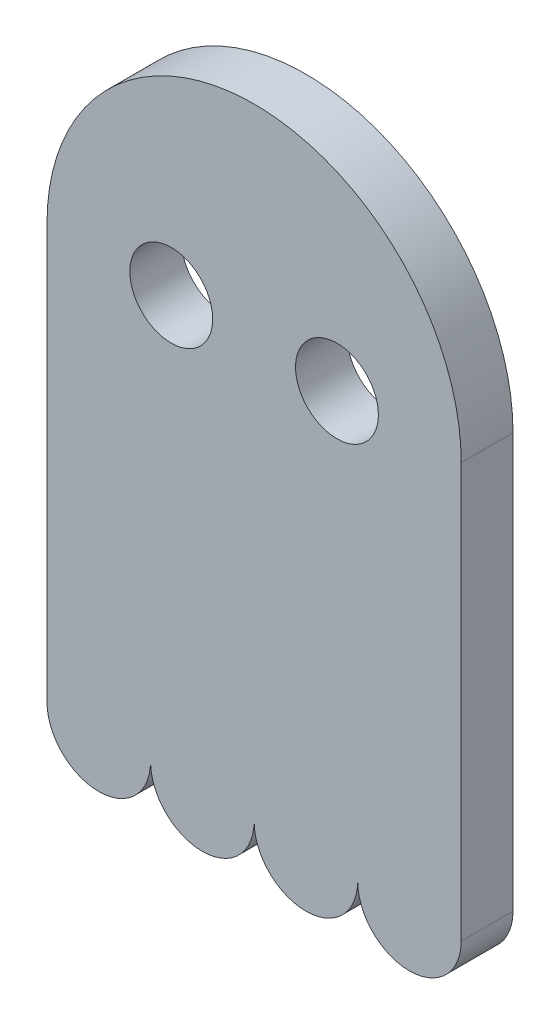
ISO-10303-21;
HEADER;
FILE_DESCRIPTION(('STEP AP214'),'2;1');
FILE_NAME('part.step','',(''),(''),'','','');
FILE_SCHEMA(('AUTOMOTIVE_DESIGN { 1 0 10303 214 1 1 1 1 }'));
ENDSEC;
DATA;
#1=APPLICATION_CONTEXT('core data for automotive mechanical design processes');
#2=APPLICATION_PROTOCOL_DEFINITION('international standard','automotive_design',2000,#1);
#3=PRODUCT_CONTEXT('',#1,'mechanical');
#4=PRODUCT('Part','Part','',(#3));
#5=PRODUCT_RELATED_PRODUCT_CATEGORY('part','',(#4));
#6=PRODUCT_DEFINITION_FORMATION('','',#4);
#7=PRODUCT_DEFINITION_CONTEXT('part definition',#1,'design');
#8=PRODUCT_DEFINITION('design','',#6,#7);
#9=PRODUCT_DEFINITION_SHAPE('','',#8);
#10=(LENGTH_UNIT() NAMED_UNIT(*) SI_UNIT(.MILLI.,.METRE.));
#11=(NAMED_UNIT(*) PLANE_ANGLE_UNIT() SI_UNIT($,.RADIAN.));
#12=(NAMED_UNIT(*) SI_UNIT($,.STERADIAN.) SOLID_ANGLE_UNIT());
#13=UNCERTAINTY_MEASURE_WITH_UNIT(LENGTH_MEASURE(1.E-05),#10,'distance_accuracy_value','');
#14=(GEOMETRIC_REPRESENTATION_CONTEXT(3) GLOBAL_UNCERTAINTY_ASSIGNED_CONTEXT((#13)) GLOBAL_UNIT_ASSIGNED_CONTEXT((#10,
#11,#12)) REPRESENTATION_CONTEXT('',''));
#15=CARTESIAN_POINT('',(0.,0.,0.));
#16=DIRECTION('',(0.,0.,1.));
#17=DIRECTION('',(1.,0.,0.));
#18=AXIS2_PLACEMENT_3D('',#15,#16,#17);
#19=CARTESIAN_POINT('',(-5.,0.,5.));
#20=DIRECTION('',(0.,0.,-1.));
#21=DIRECTION('',(-1.,0.,0.));
#22=AXIS2_PLACEMENT_3D('',#19,#20,#21);
#23=PLANE('',#22);
#24=CARTESIAN_POINT('',(8.,40.,5.));
#25=DIRECTION('',(0.,0.,1.));
#26=DIRECTION('',(1.,0.,0.));
#27=AXIS2_PLACEMENT_3D('',#24,#25,#26);
#28=CIRCLE('',#27,4.);
#29=CARTESIAN_POINT('',(12.,40.,5.));
#30=VERTEX_POINT('',#29);
#31=EDGE_CURVE('E126',#30,#30,#28,.T.);
#32=ORIENTED_EDGE('',*,*,#31,.F.);
#33=EDGE_LOOP('',(#32));
#34=FACE_BOUND('',#33,.T.);
#35=CARTESIAN_POINT('',(-5.,0.,5.));
#36=DIRECTION('',(0.,0.,1.));
#37=DIRECTION('',(-1.,0.,0.));
#38=AXIS2_PLACEMENT_3D('',#35,#36,#37);
#39=CIRCLE('',#38,5.);
#40=CARTESIAN_POINT('',(-10.,0.,5.));
#41=VERTEX_POINT('',#40);
#42=CARTESIAN_POINT('',(0.,0.,5.));
#43=VERTEX_POINT('',#42);
#44=EDGE_CURVE('E135',#41,#43,#39,.T.);
#45=ORIENTED_EDGE('',*,*,#44,.T.);
#46=CARTESIAN_POINT('',(5.,0.,5.));
#47=DIRECTION('',(0.,0.,1.));
#48=DIRECTION('',(1.,0.,0.));
#49=AXIS2_PLACEMENT_3D('',#46,#47,#48);
#50=CIRCLE('',#49,5.);
#51=CARTESIAN_POINT('',(10.,0.,5.));
#52=VERTEX_POINT('',#51);
#53=EDGE_CURVE('E88',#43,#52,#50,.T.);
#54=ORIENTED_EDGE('',*,*,#53,.T.);
#55=CARTESIAN_POINT('',(15.,0.,5.));
#56=DIRECTION('',(0.,0.,1.));
#57=DIRECTION('',(1.,0.,0.));
#58=AXIS2_PLACEMENT_3D('',#55,#56,#57);
#59=CIRCLE('',#58,5.);
#60=CARTESIAN_POINT('',(20.,0.,5.));
#61=VERTEX_POINT('',#60);
#62=EDGE_CURVE('E147',#52,#61,#59,.T.);
#63=ORIENTED_EDGE('',*,*,#62,.T.);
#64=DIRECTION('',(0.,1.,0.));
#65=VECTOR('',#64,1.);
#66=CARTESIAN_POINT('',(20.,0.,5.));
#67=LINE('',#66,#65);
#68=CARTESIAN_POINT('',(20.,40.,5.));
#69=VERTEX_POINT('',#68);
#70=EDGE_CURVE('E104',#61,#69,#67,.T.);
#71=ORIENTED_EDGE('',*,*,#70,.T.);
#72=CARTESIAN_POINT('',(0.,40.,5.));
#73=DIRECTION('',(0.,0.,1.));
#74=DIRECTION('',(1.,0.,0.));
#75=AXIS2_PLACEMENT_3D('',#72,#73,#74);
#76=CIRCLE('',#75,20.);
#77=CARTESIAN_POINT('',(-20.,40.,5.));
#78=VERTEX_POINT('',#77);
#79=EDGE_CURVE('E98',#69,#78,#76,.T.);
#80=ORIENTED_EDGE('',*,*,#79,.T.);
#81=DIRECTION('',(0.,-1.,0.));
#82=VECTOR('',#81,1.);
#83=CARTESIAN_POINT('',(-20.,0.,5.));
#84=LINE('',#83,#82);
#85=CARTESIAN_POINT('',(-20.,0.,5.));
#86=VERTEX_POINT('',#85);
#87=EDGE_CURVE('E102',#78,#86,#84,.T.);
#88=ORIENTED_EDGE('',*,*,#87,.T.);
#89=CARTESIAN_POINT('',(-15.,0.,5.));
#90=DIRECTION('',(0.,0.,1.));
#91=DIRECTION('',(-1.,0.,0.));
#92=AXIS2_PLACEMENT_3D('',#89,#90,#91);
#93=CIRCLE('',#92,5.);
#94=EDGE_CURVE('E48',#86,#41,#93,.T.);
#95=ORIENTED_EDGE('',*,*,#94,.T.);
#96=EDGE_LOOP('',(#45,#54,#63,#71,#80,#88,#95));
#97=FACE_BOUND('',#96,.T.);
#98=CARTESIAN_POINT('',(-8.,40.,5.));
#99=DIRECTION('',(0.,0.,1.));
#100=DIRECTION('',(-1.,0.,0.));
#101=AXIS2_PLACEMENT_3D('',#98,#99,#100);
#102=CIRCLE('',#101,4.);
#103=CARTESIAN_POINT('',(-12.,40.,5.));
#104=VERTEX_POINT('',#103);
#105=EDGE_CURVE('E162',#104,#104,#102,.T.);
#106=ORIENTED_EDGE('',*,*,#105,.F.);
#107=EDGE_LOOP('',(#106));
#108=FACE_BOUND('',#107,.T.);
#109=ADVANCED_FACE('F31',(#34,#97,#108),#23,.F.);
#110=CARTESIAN_POINT('',(-5.,0.,0.));
#111=DIRECTION('',(0.,0.,-1.));
#112=DIRECTION('',(-1.,0.,0.));
#113=AXIS2_PLACEMENT_3D('',#110,#111,#112);
#114=PLANE('',#113);
#115=CARTESIAN_POINT('',(8.,40.,0.));
#116=DIRECTION('',(0.,0.,1.));
#117=DIRECTION('',(1.,0.,0.));
#118=AXIS2_PLACEMENT_3D('',#115,#116,#117);
#119=CIRCLE('',#118,4.);
#120=CARTESIAN_POINT('',(12.,40.,0.));
#121=VERTEX_POINT('',#120);
#122=EDGE_CURVE('E159',#121,#121,#119,.T.);
#123=ORIENTED_EDGE('',*,*,#122,.T.);
#124=EDGE_LOOP('',(#123));
#125=FACE_BOUND('',#124,.T.);
#126=CARTESIAN_POINT('',(-5.,0.,0.));
#127=DIRECTION('',(0.,0.,1.));
#128=DIRECTION('',(-1.,0.,0.));
#129=AXIS2_PLACEMENT_3D('',#126,#127,#128);
#130=CIRCLE('',#129,5.);
#131=CARTESIAN_POINT('',(-10.,0.,0.));
#132=VERTEX_POINT('',#131);
#133=CARTESIAN_POINT('',(0.,0.,0.));
#134=VERTEX_POINT('',#133);
#135=EDGE_CURVE('E122',#132,#134,#130,.T.);
#136=ORIENTED_EDGE('',*,*,#135,.F.);
#137=CARTESIAN_POINT('',(-15.,0.,0.));
#138=DIRECTION('',(0.,0.,1.));
#139=DIRECTION('',(-1.,0.,0.));
#140=AXIS2_PLACEMENT_3D('',#137,#138,#139);
#141=CIRCLE('',#140,5.);
#142=CARTESIAN_POINT('',(-20.,0.,0.));
#143=VERTEX_POINT('',#142);
#144=EDGE_CURVE('E80',#143,#132,#141,.T.);
#145=ORIENTED_EDGE('',*,*,#144,.F.);
#146=DIRECTION('',(0.,-1.,0.));
#147=VECTOR('',#146,1.);
#148=CARTESIAN_POINT('',(-20.,0.,0.));
#149=LINE('',#148,#147);
#150=CARTESIAN_POINT('',(-20.,40.,0.));
#151=VERTEX_POINT('',#150);
#152=EDGE_CURVE('E74',#151,#143,#149,.T.);
#153=ORIENTED_EDGE('',*,*,#152,.F.);
#154=CARTESIAN_POINT('',(0.,40.,0.));
#155=DIRECTION('',(0.,0.,1.));
#156=DIRECTION('',(1.,0.,0.));
#157=AXIS2_PLACEMENT_3D('',#154,#155,#156);
#158=CIRCLE('',#157,20.);
#159=CARTESIAN_POINT('',(20.,40.,0.));
#160=VERTEX_POINT('',#159);
#161=EDGE_CURVE('E112',#160,#151,#158,.T.);
#162=ORIENTED_EDGE('',*,*,#161,.F.);
#163=DIRECTION('',(0.,1.,0.));
#164=VECTOR('',#163,1.);
#165=CARTESIAN_POINT('',(20.,0.,0.));
#166=LINE('',#165,#164);
#167=CARTESIAN_POINT('',(20.,0.,0.));
#168=VERTEX_POINT('',#167);
#169=EDGE_CURVE('E130',#168,#160,#166,.T.);
#170=ORIENTED_EDGE('',*,*,#169,.F.);
#171=CARTESIAN_POINT('',(15.,0.,0.));
#172=DIRECTION('',(0.,0.,1.));
#173=DIRECTION('',(1.,0.,0.));
#174=AXIS2_PLACEMENT_3D('',#171,#172,#173);
#175=CIRCLE('',#174,5.);
#176=CARTESIAN_POINT('',(10.,0.,0.));
#177=VERTEX_POINT('',#176);
#178=EDGE_CURVE('E128',#177,#168,#175,.T.);
#179=ORIENTED_EDGE('',*,*,#178,.F.);
#180=CARTESIAN_POINT('',(5.,0.,0.));
#181=DIRECTION('',(0.,0.,1.));
#182=DIRECTION('',(1.,0.,0.));
#183=AXIS2_PLACEMENT_3D('',#180,#181,#182);
#184=CIRCLE('',#183,5.);
#185=EDGE_CURVE('E125',#134,#177,#184,.T.);
#186=ORIENTED_EDGE('',*,*,#185,.F.);
#187=EDGE_LOOP('',(#136,#145,#153,#162,#170,#179,#186));
#188=FACE_BOUND('',#187,.T.);
#189=CARTESIAN_POINT('',(-8.,40.,0.));
#190=DIRECTION('',(0.,0.,1.));
#191=DIRECTION('',(-1.,0.,0.));
#192=AXIS2_PLACEMENT_3D('',#189,#190,#191);
#193=CIRCLE('',#192,4.);
#194=CARTESIAN_POINT('',(-12.,40.,0.));
#195=VERTEX_POINT('',#194);
#196=EDGE_CURVE('E165',#195,#195,#193,.T.);
#197=ORIENTED_EDGE('',*,*,#196,.T.);
#198=EDGE_LOOP('',(#197));
#199=FACE_BOUND('',#198,.T.);
#200=ADVANCED_FACE('F151',(#125,#188,#199),#114,.T.);
#201=CARTESIAN_POINT('',(-5.,0.,5.));
#202=DIRECTION('',(0.,0.,-1.));
#203=DIRECTION('',(-1.,0.,0.));
#204=AXIS2_PLACEMENT_3D('',#201,#202,#203);
#205=CYLINDRICAL_SURFACE('',#204,5.);
#206=ORIENTED_EDGE('',*,*,#135,.T.);
#207=DIRECTION('',(0.,0.,-1.));
#208=VECTOR('',#207,1.);
#209=CARTESIAN_POINT('',(0.,0.,5.));
#210=LINE('',#209,#208);
#211=EDGE_CURVE('E11',#43,#134,#210,.T.);
#212=ORIENTED_EDGE('',*,*,#211,.F.);
#213=ORIENTED_EDGE('',*,*,#44,.F.);
#214=DIRECTION('',(0.,0.,-1.));
#215=VECTOR('',#214,1.);
#216=CARTESIAN_POINT('',(-10.,0.,5.));
#217=LINE('',#216,#215);
#218=EDGE_CURVE('E118',#41,#132,#217,.T.);
#219=ORIENTED_EDGE('',*,*,#218,.T.);
#220=EDGE_LOOP('',(#206,#212,#213,#219));
#221=FACE_BOUND('',#220,.T.);
#222=ADVANCED_FACE('F33',(#221),#205,.T.);
#223=CARTESIAN_POINT('',(5.,0.,5.));
#224=DIRECTION('',(0.,0.,-1.));
#225=DIRECTION('',(-1.,0.,0.));
#226=AXIS2_PLACEMENT_3D('',#223,#224,#225);
#227=CYLINDRICAL_SURFACE('',#226,5.);
#228=ORIENTED_EDGE('',*,*,#185,.T.);
#229=DIRECTION('',(0.,0.,-1.));
#230=VECTOR('',#229,1.);
#231=CARTESIAN_POINT('',(10.,0.,5.));
#232=LINE('',#231,#230);
#233=EDGE_CURVE('E40',#52,#177,#232,.T.);
#234=ORIENTED_EDGE('',*,*,#233,.F.);
#235=ORIENTED_EDGE('',*,*,#53,.F.);
#236=ORIENTED_EDGE('',*,*,#211,.T.);
#237=EDGE_LOOP('',(#228,#234,#235,#236));
#238=FACE_BOUND('',#237,.T.);
#239=ADVANCED_FACE('F196',(#238),#227,.T.);
#240=CARTESIAN_POINT('',(15.,0.,5.));
#241=DIRECTION('',(0.,0.,-1.));
#242=DIRECTION('',(-1.,0.,0.));
#243=AXIS2_PLACEMENT_3D('',#240,#241,#242);
#244=CYLINDRICAL_SURFACE('',#243,5.);
#245=ORIENTED_EDGE('',*,*,#178,.T.);
#246=DIRECTION('',(0.,0.,-1.));
#247=VECTOR('',#246,1.);
#248=CARTESIAN_POINT('',(20.,0.,5.));
#249=LINE('',#248,#247);
#250=EDGE_CURVE('E139',#61,#168,#249,.T.);
#251=ORIENTED_EDGE('',*,*,#250,.F.);
#252=ORIENTED_EDGE('',*,*,#62,.F.);
#253=ORIENTED_EDGE('',*,*,#233,.T.);
#254=EDGE_LOOP('',(#245,#251,#252,#253));
#255=FACE_BOUND('',#254,.T.);
#256=ADVANCED_FACE('F145',(#255),#244,.T.);
#257=CARTESIAN_POINT('',(20.,0.,5.));
#258=DIRECTION('',(-1.,0.,0.));
#259=DIRECTION('',(0.,0.,1.));
#260=AXIS2_PLACEMENT_3D('',#257,#258,#259);
#261=PLANE('',#260);
#262=ORIENTED_EDGE('',*,*,#169,.T.);
#263=DIRECTION('',(0.,0.,-1.));
#264=VECTOR('',#263,1.);
#265=CARTESIAN_POINT('',(20.,40.,5.));
#266=LINE('',#265,#264);
#267=EDGE_CURVE('E113',#69,#160,#266,.T.);
#268=ORIENTED_EDGE('',*,*,#267,.F.);
#269=ORIENTED_EDGE('',*,*,#70,.F.);
#270=ORIENTED_EDGE('',*,*,#250,.T.);
#271=EDGE_LOOP('',(#262,#268,#269,#270));
#272=FACE_BOUND('',#271,.T.);
#273=ADVANCED_FACE('F154',(#272),#261,.F.);
#274=CARTESIAN_POINT('',(0.,40.,5.));
#275=DIRECTION('',(0.,0.,-1.));
#276=DIRECTION('',(-1.,0.,0.));
#277=AXIS2_PLACEMENT_3D('',#274,#275,#276);
#278=CYLINDRICAL_SURFACE('',#277,20.);
#279=ORIENTED_EDGE('',*,*,#161,.T.);
#280=DIRECTION('',(0.,0.,-1.));
#281=VECTOR('',#280,1.);
#282=CARTESIAN_POINT('',(-20.,40.,5.));
#283=LINE('',#282,#281);
#284=EDGE_CURVE('E109',#78,#151,#283,.T.);
#285=ORIENTED_EDGE('',*,*,#284,.F.);
#286=ORIENTED_EDGE('',*,*,#79,.F.);
#287=ORIENTED_EDGE('',*,*,#267,.T.);
#288=EDGE_LOOP('',(#279,#285,#286,#287));
#289=FACE_BOUND('',#288,.T.);
#290=ADVANCED_FACE('F110',(#289),#278,.T.);
#291=CARTESIAN_POINT('',(-20.,0.,5.));
#292=DIRECTION('',(1.,0.,0.));
#293=DIRECTION('',(0.,0.,-1.));
#294=AXIS2_PLACEMENT_3D('',#291,#292,#293);
#295=PLANE('',#294);
#296=ORIENTED_EDGE('',*,*,#152,.T.);
#297=DIRECTION('',(0.,0.,-1.));
#298=VECTOR('',#297,1.);
#299=CARTESIAN_POINT('',(-20.,0.,5.));
#300=LINE('',#299,#298);
#301=EDGE_CURVE('E114',#86,#143,#300,.T.);
#302=ORIENTED_EDGE('',*,*,#301,.F.);
#303=ORIENTED_EDGE('',*,*,#87,.F.);
#304=ORIENTED_EDGE('',*,*,#284,.T.);
#305=EDGE_LOOP('',(#296,#302,#303,#304));
#306=FACE_BOUND('',#305,.T.);
#307=ADVANCED_FACE('F116',(#306),#295,.F.);
#308=CARTESIAN_POINT('',(-15.,0.,5.));
#309=DIRECTION('',(0.,0.,-1.));
#310=DIRECTION('',(-1.,0.,0.));
#311=AXIS2_PLACEMENT_3D('',#308,#309,#310);
#312=CYLINDRICAL_SURFACE('',#311,5.);
#313=ORIENTED_EDGE('',*,*,#144,.T.);
#314=ORIENTED_EDGE('',*,*,#218,.F.);
#315=ORIENTED_EDGE('',*,*,#94,.F.);
#316=ORIENTED_EDGE('',*,*,#301,.T.);
#317=EDGE_LOOP('',(#313,#314,#315,#316));
#318=FACE_BOUND('',#317,.T.);
#319=ADVANCED_FACE('F186',(#318),#312,.T.);
#320=CARTESIAN_POINT('',(8.,40.,5.));
#321=DIRECTION('',(0.,0.,-1.));
#322=DIRECTION('',(-1.,0.,0.));
#323=AXIS2_PLACEMENT_3D('',#320,#321,#322);
#324=CYLINDRICAL_SURFACE('',#323,4.);
#325=ORIENTED_EDGE('',*,*,#31,.T.);
#326=EDGE_LOOP('',(#325));
#327=FACE_BOUND('',#326,.T.);
#328=ORIENTED_EDGE('',*,*,#122,.F.);
#329=EDGE_LOOP('',(#328));
#330=FACE_BOUND('',#329,.T.);
#331=ADVANCED_FACE('F183',(#327,#330),#324,.F.);
#332=CARTESIAN_POINT('',(-8.,40.,5.));
#333=DIRECTION('',(0.,0.,-1.));
#334=DIRECTION('',(-1.,0.,0.));
#335=AXIS2_PLACEMENT_3D('',#332,#333,#334);
#336=CYLINDRICAL_SURFACE('',#335,4.);
#337=ORIENTED_EDGE('',*,*,#105,.T.);
#338=EDGE_LOOP('',(#337));
#339=FACE_BOUND('',#338,.T.);
#340=ORIENTED_EDGE('',*,*,#196,.F.);
#341=EDGE_LOOP('',(#340));
#342=FACE_BOUND('',#341,.T.);
#343=ADVANCED_FACE('F171',(#339,#342),#336,.F.);
#344=CLOSED_SHELL('',(#109,#200,#222,#239,#256,#273,#290,#307,#319,#331,#343));
#345=MANIFOLD_SOLID_BREP('B2',#344);
#346=ADVANCED_BREP_SHAPE_REPRESENTATION('',(#18,#345),#14);
#347=SHAPE_DEFINITION_REPRESENTATION(#9,#346);
ENDSEC;
END-ISO-10303-21;
